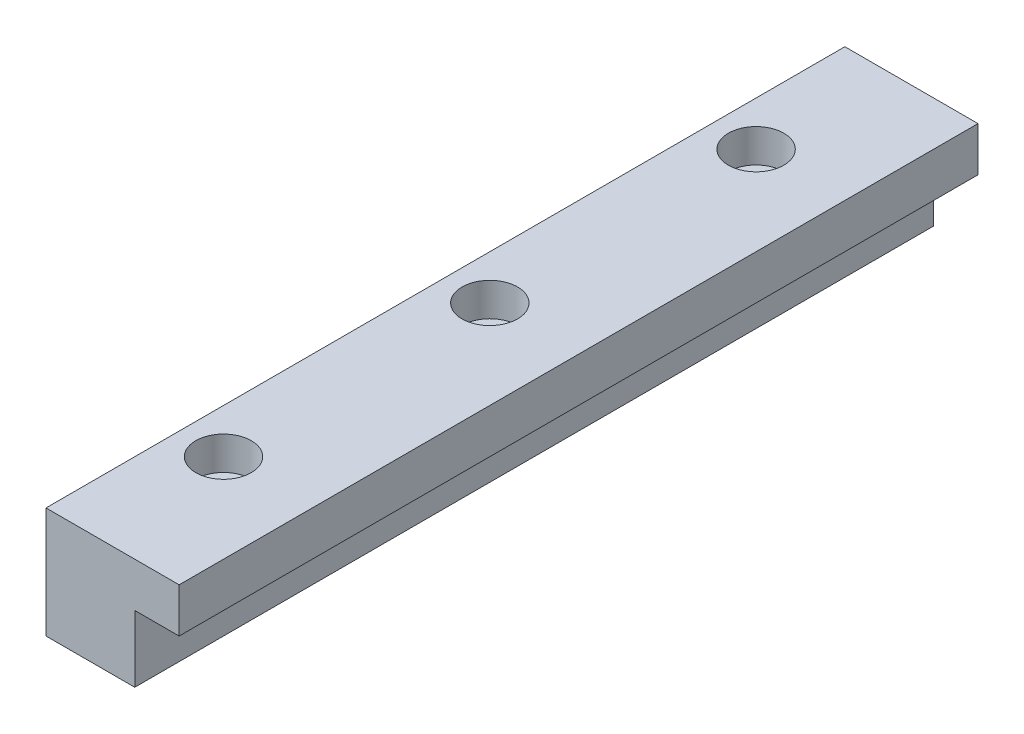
ISO-10303-21;
HEADER;
FILE_DESCRIPTION(('STEP AP214'),'2;1');
FILE_NAME('part.step','',(''),(''),'','','');
FILE_SCHEMA(('AUTOMOTIVE_DESIGN { 1 0 10303 214 1 1 1 1 }'));
ENDSEC;
DATA;
#1=APPLICATION_CONTEXT('core data for automotive mechanical design processes');
#2=APPLICATION_PROTOCOL_DEFINITION('international standard','automotive_design',2000,#1);
#3=PRODUCT_CONTEXT('',#1,'mechanical');
#4=PRODUCT('Part','Part','',(#3));
#5=PRODUCT_RELATED_PRODUCT_CATEGORY('part','',(#4));
#6=PRODUCT_DEFINITION_FORMATION('','',#4);
#7=PRODUCT_DEFINITION_CONTEXT('part definition',#1,'design');
#8=PRODUCT_DEFINITION('design','',#6,#7);
#9=PRODUCT_DEFINITION_SHAPE('','',#8);
#10=(LENGTH_UNIT() NAMED_UNIT(*) SI_UNIT(.MILLI.,.METRE.));
#11=(NAMED_UNIT(*) PLANE_ANGLE_UNIT() SI_UNIT($,.RADIAN.));
#12=(NAMED_UNIT(*) SI_UNIT($,.STERADIAN.) SOLID_ANGLE_UNIT());
#13=UNCERTAINTY_MEASURE_WITH_UNIT(LENGTH_MEASURE(1.E-05),#10,'distance_accuracy_value','');
#14=(GEOMETRIC_REPRESENTATION_CONTEXT(3) GLOBAL_UNCERTAINTY_ASSIGNED_CONTEXT((#13)) GLOBAL_UNIT_ASSIGNED_CONTEXT((#10,
#11,#12)) REPRESENTATION_CONTEXT('',''));
#15=CARTESIAN_POINT('',(0.,0.,0.));
#16=DIRECTION('',(0.,0.,1.));
#17=DIRECTION('',(1.,0.,0.));
#18=AXIS2_PLACEMENT_3D('',#15,#16,#17);
#19=CARTESIAN_POINT('',(6.35,-15.875,114.3));
#20=DIRECTION('',(0.,1.,0.));
#21=DIRECTION('',(-1.,0.,0.));
#22=AXIS2_PLACEMENT_3D('',#19,#20,#21);
#23=PLANE('',#22);
#24=CARTESIAN_POINT('',(-6.35,-15.875,-76.2));
#25=DIRECTION('',(0.,1.,0.));
#26=DIRECTION('',(0.,0.,1.));
#27=AXIS2_PLACEMENT_3D('',#24,#25,#26);
#28=CIRCLE('',#27,5.04189999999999);
#29=CARTESIAN_POINT('',(-6.35,-15.875,-71.1581));
#30=VERTEX_POINT('',#29);
#31=EDGE_CURVE('E158',#30,#30,#28,.T.);
#32=ORIENTED_EDGE('',*,*,#31,.T.);
#33=EDGE_LOOP('',(#32));
#34=FACE_BOUND('',#33,.T.);
#35=CARTESIAN_POINT('',(-6.35,-15.875,0.));
#36=DIRECTION('',(0.,1.,0.));
#37=DIRECTION('',(0.,0.,1.));
#38=AXIS2_PLACEMENT_3D('',#35,#36,#37);
#39=CIRCLE('',#38,5.04189999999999);
#40=CARTESIAN_POINT('',(-6.35,-15.875,5.04189999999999));
#41=VERTEX_POINT('',#40);
#42=EDGE_CURVE('E162',#41,#41,#39,.T.);
#43=ORIENTED_EDGE('',*,*,#42,.T.);
#44=EDGE_LOOP('',(#43));
#45=FACE_BOUND('',#44,.T.);
#46=CARTESIAN_POINT('',(-6.35,-15.875,76.2));
#47=DIRECTION('',(0.,1.,0.));
#48=DIRECTION('',(0.,0.,1.));
#49=AXIS2_PLACEMENT_3D('',#46,#47,#48);
#50=CIRCLE('',#49,5.04189999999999);
#51=CARTESIAN_POINT('',(-6.35,-15.875,81.2419));
#52=VERTEX_POINT('',#51);
#53=EDGE_CURVE('E118',#52,#52,#50,.T.);
#54=ORIENTED_EDGE('',*,*,#53,.T.);
#55=EDGE_LOOP('',(#54));
#56=FACE_BOUND('',#55,.T.);
#57=DIRECTION('',(1.,0.,0.));
#58=VECTOR('',#57,1.);
#59=CARTESIAN_POINT('',(6.35,-15.875,-114.3));
#60=LINE('',#59,#58);
#61=CARTESIAN_POINT('',(-19.05,-15.875,-114.3));
#62=VERTEX_POINT('',#61);
#63=CARTESIAN_POINT('',(6.35,-15.875,-114.3));
#64=VERTEX_POINT('',#63);
#65=EDGE_CURVE('E114',#62,#64,#60,.T.);
#66=ORIENTED_EDGE('',*,*,#65,.T.);
#67=DIRECTION('',(0.,0.,-1.));
#68=VECTOR('',#67,1.);
#69=CARTESIAN_POINT('',(6.35,-15.875,114.3));
#70=LINE('',#69,#68);
#71=CARTESIAN_POINT('',(6.35,-15.875,114.3));
#72=VERTEX_POINT('',#71);
#73=EDGE_CURVE('E11',#72,#64,#70,.T.);
#74=ORIENTED_EDGE('',*,*,#73,.F.);
#75=DIRECTION('',(1.,0.,0.));
#76=VECTOR('',#75,1.);
#77=CARTESIAN_POINT('',(6.35,-15.875,114.3));
#78=LINE('',#77,#76);
#79=CARTESIAN_POINT('',(-19.05,-15.875,114.3));
#80=VERTEX_POINT('',#79);
#81=EDGE_CURVE('E125',#80,#72,#78,.T.);
#82=ORIENTED_EDGE('',*,*,#81,.F.);
#83=DIRECTION('',(0.,0.,-1.));
#84=VECTOR('',#83,1.);
#85=CARTESIAN_POINT('',(-19.05,-15.875,114.3));
#86=LINE('',#85,#84);
#87=EDGE_CURVE('E110',#80,#62,#86,.T.);
#88=ORIENTED_EDGE('',*,*,#87,.T.);
#89=EDGE_LOOP('',(#66,#74,#82,#88));
#90=FACE_BOUND('',#89,.T.);
#91=ADVANCED_FACE('F30',(#34,#45,#56,#90),#23,.F.);
#92=CARTESIAN_POINT('',(6.35,-15.875,114.3));
#93=DIRECTION('',(-1.,0.,0.));
#94=DIRECTION('',(0.,-1.,0.));
#95=AXIS2_PLACEMENT_3D('',#92,#93,#94);
#96=PLANE('',#95);
#97=DIRECTION('',(0.,1.,0.));
#98=VECTOR('',#97,1.);
#99=CARTESIAN_POINT('',(6.35,-15.875,-114.3));
#100=LINE('',#99,#98);
#101=CARTESIAN_POINT('',(6.35,3.17499999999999,-114.3));
#102=VERTEX_POINT('',#101);
#103=EDGE_CURVE('E117',#64,#102,#100,.T.);
#104=ORIENTED_EDGE('',*,*,#103,.T.);
#105=DIRECTION('',(0.,0.,-1.));
#106=VECTOR('',#105,1.);
#107=CARTESIAN_POINT('',(6.35,3.17499999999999,114.3));
#108=LINE('',#107,#106);
#109=CARTESIAN_POINT('',(6.35,3.17499999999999,114.3));
#110=VERTEX_POINT('',#109);
#111=EDGE_CURVE('E38',#110,#102,#108,.T.);
#112=ORIENTED_EDGE('',*,*,#111,.F.);
#113=DIRECTION('',(0.,1.,0.));
#114=VECTOR('',#113,1.);
#115=CARTESIAN_POINT('',(6.35,-15.875,114.3));
#116=LINE('',#115,#114);
#117=EDGE_CURVE('E83',#72,#110,#116,.T.);
#118=ORIENTED_EDGE('',*,*,#117,.F.);
#119=ORIENTED_EDGE('',*,*,#73,.T.);
#120=EDGE_LOOP('',(#104,#112,#118,#119));
#121=FACE_BOUND('',#120,.T.);
#122=ADVANCED_FACE('F150',(#121),#96,.F.);
#123=CARTESIAN_POINT('',(19.05,3.175,114.3));
#124=DIRECTION('',(0.,1.,0.));
#125=DIRECTION('',(-1.,0.,0.));
#126=AXIS2_PLACEMENT_3D('',#123,#124,#125);
#127=PLANE('',#126);
#128=DIRECTION('',(1.,0.,0.));
#129=VECTOR('',#128,1.);
#130=CARTESIAN_POINT('',(19.05,3.175,-114.3));
#131=LINE('',#130,#129);
#132=CARTESIAN_POINT('',(19.05,3.175,-114.3));
#133=VERTEX_POINT('',#132);
#134=EDGE_CURVE('E120',#102,#133,#131,.T.);
#135=ORIENTED_EDGE('',*,*,#134,.T.);
#136=DIRECTION('',(0.,0.,-1.));
#137=VECTOR('',#136,1.);
#138=CARTESIAN_POINT('',(19.05,3.175,114.3));
#139=LINE('',#138,#137);
#140=CARTESIAN_POINT('',(19.05,3.175,114.3));
#141=VERTEX_POINT('',#140);
#142=EDGE_CURVE('E105',#141,#133,#139,.T.);
#143=ORIENTED_EDGE('',*,*,#142,.F.);
#144=DIRECTION('',(1.,0.,0.));
#145=VECTOR('',#144,1.);
#146=CARTESIAN_POINT('',(19.05,3.175,114.3));
#147=LINE('',#146,#145);
#148=EDGE_CURVE('E96',#110,#141,#147,.T.);
#149=ORIENTED_EDGE('',*,*,#148,.F.);
#150=ORIENTED_EDGE('',*,*,#111,.T.);
#151=EDGE_LOOP('',(#135,#143,#149,#150));
#152=FACE_BOUND('',#151,.T.);
#153=ADVANCED_FACE('F131',(#152),#127,.F.);
#154=CARTESIAN_POINT('',(19.05,15.875,114.3));
#155=DIRECTION('',(-1.,0.,0.));
#156=DIRECTION('',(0.,0.,1.));
#157=AXIS2_PLACEMENT_3D('',#154,#155,#156);
#158=PLANE('',#157);
#159=DIRECTION('',(0.,1.,0.));
#160=VECTOR('',#159,1.);
#161=CARTESIAN_POINT('',(19.05,15.875,-114.3));
#162=LINE('',#161,#160);
#163=CARTESIAN_POINT('',(19.05,15.875,-114.3));
#164=VERTEX_POINT('',#163);
#165=EDGE_CURVE('E104',#133,#164,#162,.T.);
#166=ORIENTED_EDGE('',*,*,#165,.T.);
#167=DIRECTION('',(0.,0.,-1.));
#168=VECTOR('',#167,1.);
#169=CARTESIAN_POINT('',(19.05,15.875,114.3));
#170=LINE('',#169,#168);
#171=CARTESIAN_POINT('',(19.05,15.875,114.3));
#172=VERTEX_POINT('',#171);
#173=EDGE_CURVE('E101',#172,#164,#170,.T.);
#174=ORIENTED_EDGE('',*,*,#173,.F.);
#175=DIRECTION('',(0.,1.,0.));
#176=VECTOR('',#175,1.);
#177=CARTESIAN_POINT('',(19.05,15.875,114.3));
#178=LINE('',#177,#176);
#179=EDGE_CURVE('E90',#141,#172,#178,.T.);
#180=ORIENTED_EDGE('',*,*,#179,.F.);
#181=ORIENTED_EDGE('',*,*,#142,.T.);
#182=EDGE_LOOP('',(#166,#174,#180,#181));
#183=FACE_BOUND('',#182,.T.);
#184=ADVANCED_FACE('F102',(#183),#158,.F.);
#185=CARTESIAN_POINT('',(-19.05,15.875,114.3));
#186=DIRECTION('',(0.,-1.,0.));
#187=DIRECTION('',(0.,0.,-1.));
#188=AXIS2_PLACEMENT_3D('',#185,#186,#187);
#189=PLANE('',#188);
#190=CARTESIAN_POINT('',(-6.35,15.875,-76.2));
#191=DIRECTION('',(0.,1.,0.));
#192=DIRECTION('',(0.,0.,1.));
#193=AXIS2_PLACEMENT_3D('',#190,#191,#192);
#194=CIRCLE('',#193,7.9375);
#195=CARTESIAN_POINT('',(-6.35,15.875,-68.2625));
#196=VERTEX_POINT('',#195);
#197=EDGE_CURVE('E196',#196,#196,#194,.T.);
#198=ORIENTED_EDGE('',*,*,#197,.F.);
#199=EDGE_LOOP('',(#198));
#200=FACE_BOUND('',#199,.T.);
#201=CARTESIAN_POINT('',(-6.35,15.875,0.));
#202=DIRECTION('',(0.,1.,0.));
#203=DIRECTION('',(0.,0.,1.));
#204=AXIS2_PLACEMENT_3D('',#201,#202,#203);
#205=CIRCLE('',#204,7.9375);
#206=CARTESIAN_POINT('',(-6.35,15.875,7.9375));
#207=VERTEX_POINT('',#206);
#208=EDGE_CURVE('E186',#207,#207,#205,.T.);
#209=ORIENTED_EDGE('',*,*,#208,.F.);
#210=EDGE_LOOP('',(#209));
#211=FACE_BOUND('',#210,.T.);
#212=CARTESIAN_POINT('',(-6.35,15.875,76.2));
#213=DIRECTION('',(0.,1.,0.));
#214=DIRECTION('',(0.,0.,1.));
#215=AXIS2_PLACEMENT_3D('',#212,#213,#214);
#216=CIRCLE('',#215,7.9375);
#217=CARTESIAN_POINT('',(-6.35,15.875,84.1375));
#218=VERTEX_POINT('',#217);
#219=EDGE_CURVE('E176',#218,#218,#216,.T.);
#220=ORIENTED_EDGE('',*,*,#219,.F.);
#221=EDGE_LOOP('',(#220));
#222=FACE_BOUND('',#221,.T.);
#223=DIRECTION('',(-1.,0.,0.));
#224=VECTOR('',#223,1.);
#225=CARTESIAN_POINT('',(-19.05,15.875,-114.3));
#226=LINE('',#225,#224);
#227=CARTESIAN_POINT('',(-19.05,15.875,-114.3));
#228=VERTEX_POINT('',#227);
#229=EDGE_CURVE('E69',#164,#228,#226,.T.);
#230=ORIENTED_EDGE('',*,*,#229,.T.);
#231=DIRECTION('',(0.,0.,-1.));
#232=VECTOR('',#231,1.);
#233=CARTESIAN_POINT('',(-19.05,15.875,114.3));
#234=LINE('',#233,#232);
#235=CARTESIAN_POINT('',(-19.05,15.875,114.3));
#236=VERTEX_POINT('',#235);
#237=EDGE_CURVE('E106',#236,#228,#234,.T.);
#238=ORIENTED_EDGE('',*,*,#237,.F.);
#239=DIRECTION('',(-1.,0.,0.));
#240=VECTOR('',#239,1.);
#241=CARTESIAN_POINT('',(-19.05,15.875,114.3));
#242=LINE('',#241,#240);
#243=EDGE_CURVE('E94',#172,#236,#242,.T.);
#244=ORIENTED_EDGE('',*,*,#243,.F.);
#245=ORIENTED_EDGE('',*,*,#173,.T.);
#246=EDGE_LOOP('',(#230,#238,#244,#245));
#247=FACE_BOUND('',#246,.T.);
#248=ADVANCED_FACE('F108',(#200,#211,#222,#247),#189,.F.);
#249=CARTESIAN_POINT('',(-19.05,-15.875,114.3));
#250=DIRECTION('',(1.,0.,0.));
#251=DIRECTION('',(0.,1.,0.));
#252=AXIS2_PLACEMENT_3D('',#249,#250,#251);
#253=PLANE('',#252);
#254=DIRECTION('',(0.,-1.,0.));
#255=VECTOR('',#254,1.);
#256=CARTESIAN_POINT('',(-19.05,-15.875,-114.3));
#257=LINE('',#256,#255);
#258=EDGE_CURVE('E75',#228,#62,#257,.T.);
#259=ORIENTED_EDGE('',*,*,#258,.T.);
#260=ORIENTED_EDGE('',*,*,#87,.F.);
#261=DIRECTION('',(0.,-1.,0.));
#262=VECTOR('',#261,1.);
#263=CARTESIAN_POINT('',(-19.05,-15.875,114.3));
#264=LINE('',#263,#262);
#265=EDGE_CURVE('E46',#236,#80,#264,.T.);
#266=ORIENTED_EDGE('',*,*,#265,.F.);
#267=ORIENTED_EDGE('',*,*,#237,.T.);
#268=EDGE_LOOP('',(#259,#260,#266,#267));
#269=FACE_BOUND('',#268,.T.);
#270=ADVANCED_FACE('F138',(#269),#253,.F.);
#271=CARTESIAN_POINT('',(-19.05,-15.875,114.3));
#272=DIRECTION('',(0.,0.,-1.));
#273=DIRECTION('',(-1.,0.,0.));
#274=AXIS2_PLACEMENT_3D('',#271,#272,#273);
#275=PLANE('',#274);
#276=ORIENTED_EDGE('',*,*,#81,.T.);
#277=ORIENTED_EDGE('',*,*,#117,.T.);
#278=ORIENTED_EDGE('',*,*,#148,.T.);
#279=ORIENTED_EDGE('',*,*,#179,.T.);
#280=ORIENTED_EDGE('',*,*,#243,.T.);
#281=ORIENTED_EDGE('',*,*,#265,.T.);
#282=EDGE_LOOP('',(#276,#277,#278,#279,#280,#281));
#283=FACE_BOUND('',#282,.T.);
#284=ADVANCED_FACE('F92',(#283),#275,.F.);
#285=CARTESIAN_POINT('',(-19.05,-15.875,-114.3));
#286=DIRECTION('',(0.,0.,-1.));
#287=DIRECTION('',(-1.,0.,0.));
#288=AXIS2_PLACEMENT_3D('',#285,#286,#287);
#289=PLANE('',#288);
#290=ORIENTED_EDGE('',*,*,#65,.F.);
#291=ORIENTED_EDGE('',*,*,#258,.F.);
#292=ORIENTED_EDGE('',*,*,#229,.F.);
#293=ORIENTED_EDGE('',*,*,#165,.F.);
#294=ORIENTED_EDGE('',*,*,#134,.F.);
#295=ORIENTED_EDGE('',*,*,#103,.F.);
#296=EDGE_LOOP('',(#290,#291,#292,#293,#294,#295));
#297=FACE_BOUND('',#296,.T.);
#298=ADVANCED_FACE('F134',(#297),#289,.T.);
#299=CARTESIAN_POINT('',(-6.35,15.875,76.2));
#300=DIRECTION('',(0.,1.,0.));
#301=DIRECTION('',(0.,0.,1.));
#302=AXIS2_PLACEMENT_3D('',#299,#300,#301);
#303=CYLINDRICAL_SURFACE('',#302,5.0419);
#304=ORIENTED_EDGE('',*,*,#53,.F.);
#305=EDGE_LOOP('',(#304));
#306=FACE_BOUND('',#305,.T.);
#307=CARTESIAN_POINT('',(-6.35,6.35,76.2));
#308=DIRECTION('',(0.,1.,0.));
#309=DIRECTION('',(0.,0.,1.));
#310=AXIS2_PLACEMENT_3D('',#307,#308,#309);
#311=CIRCLE('',#310,5.0419);
#312=CARTESIAN_POINT('',(-6.35,6.35,81.2419));
#313=VERTEX_POINT('',#312);
#314=EDGE_CURVE('E166',#313,#313,#311,.T.);
#315=ORIENTED_EDGE('',*,*,#314,.T.);
#316=EDGE_LOOP('',(#315));
#317=FACE_BOUND('',#316,.T.);
#318=ADVANCED_FACE('F219',(#306,#317),#303,.F.);
#319=CARTESIAN_POINT('',(-1.3081,6.35,76.2));
#320=DIRECTION('',(0.,-1.,0.));
#321=DIRECTION('',(0.,0.,-1.));
#322=AXIS2_PLACEMENT_3D('',#319,#320,#321);
#323=PLANE('',#322);
#324=ORIENTED_EDGE('',*,*,#314,.F.);
#325=EDGE_LOOP('',(#324));
#326=FACE_BOUND('',#325,.T.);
#327=CARTESIAN_POINT('',(-6.35,6.35,76.2));
#328=DIRECTION('',(0.,1.,0.));
#329=DIRECTION('',(0.,0.,1.));
#330=AXIS2_PLACEMENT_3D('',#327,#328,#329);
#331=CIRCLE('',#330,7.9375);
#332=CARTESIAN_POINT('',(-6.35,6.35,84.1375));
#333=VERTEX_POINT('',#332);
#334=EDGE_CURVE('E169',#333,#333,#331,.T.);
#335=ORIENTED_EDGE('',*,*,#334,.T.);
#336=EDGE_LOOP('',(#335));
#337=FACE_BOUND('',#336,.T.);
#338=ADVANCED_FACE('F209',(#326,#337),#323,.F.);
#339=CARTESIAN_POINT('',(-6.35,15.875,76.2));
#340=DIRECTION('',(0.,1.,0.));
#341=DIRECTION('',(0.,0.,1.));
#342=AXIS2_PLACEMENT_3D('',#339,#340,#341);
#343=CYLINDRICAL_SURFACE('',#342,7.9375);
#344=ORIENTED_EDGE('',*,*,#334,.F.);
#345=EDGE_LOOP('',(#344));
#346=FACE_BOUND('',#345,.T.);
#347=ORIENTED_EDGE('',*,*,#219,.T.);
#348=EDGE_LOOP('',(#347));
#349=FACE_BOUND('',#348,.T.);
#350=ADVANCED_FACE('F206',(#346,#349),#343,.F.);
#351=CARTESIAN_POINT('',(-6.35,15.875,0.));
#352=DIRECTION('',(0.,1.,0.));
#353=DIRECTION('',(0.,0.,1.));
#354=AXIS2_PLACEMENT_3D('',#351,#352,#353);
#355=CYLINDRICAL_SURFACE('',#354,5.0419);
#356=ORIENTED_EDGE('',*,*,#42,.F.);
#357=EDGE_LOOP('',(#356));
#358=FACE_BOUND('',#357,.T.);
#359=CARTESIAN_POINT('',(-6.35,6.35,0.));
#360=DIRECTION('',(0.,1.,0.));
#361=DIRECTION('',(0.,0.,1.));
#362=AXIS2_PLACEMENT_3D('',#359,#360,#361);
#363=CIRCLE('',#362,5.0419);
#364=CARTESIAN_POINT('',(-6.35,6.35,5.0419));
#365=VERTEX_POINT('',#364);
#366=EDGE_CURVE('E180',#365,#365,#363,.T.);
#367=ORIENTED_EDGE('',*,*,#366,.T.);
#368=EDGE_LOOP('',(#367));
#369=FACE_BOUND('',#368,.T.);
#370=ADVANCED_FACE('F208',(#358,#369),#355,.F.);
#371=CARTESIAN_POINT('',(-1.3081,6.35,0.));
#372=DIRECTION('',(0.,-1.,0.));
#373=DIRECTION('',(0.,0.,-1.));
#374=AXIS2_PLACEMENT_3D('',#371,#372,#373);
#375=PLANE('',#374);
#376=ORIENTED_EDGE('',*,*,#366,.F.);
#377=EDGE_LOOP('',(#376));
#378=FACE_BOUND('',#377,.T.);
#379=CARTESIAN_POINT('',(-6.35,6.35,0.));
#380=DIRECTION('',(0.,1.,0.));
#381=DIRECTION('',(0.,0.,1.));
#382=AXIS2_PLACEMENT_3D('',#379,#380,#381);
#383=CIRCLE('',#382,7.9375);
#384=CARTESIAN_POINT('',(-6.35,6.35,7.9375));
#385=VERTEX_POINT('',#384);
#386=EDGE_CURVE('E183',#385,#385,#383,.T.);
#387=ORIENTED_EDGE('',*,*,#386,.T.);
#388=EDGE_LOOP('',(#387));
#389=FACE_BOUND('',#388,.T.);
#390=ADVANCED_FACE('F216',(#378,#389),#375,.F.);
#391=CARTESIAN_POINT('',(-6.35,15.875,0.));
#392=DIRECTION('',(0.,1.,0.));
#393=DIRECTION('',(0.,0.,1.));
#394=AXIS2_PLACEMENT_3D('',#391,#392,#393);
#395=CYLINDRICAL_SURFACE('',#394,7.9375);
#396=ORIENTED_EDGE('',*,*,#386,.F.);
#397=EDGE_LOOP('',(#396));
#398=FACE_BOUND('',#397,.T.);
#399=ORIENTED_EDGE('',*,*,#208,.T.);
#400=EDGE_LOOP('',(#399));
#401=FACE_BOUND('',#400,.T.);
#402=ADVANCED_FACE('F258',(#398,#401),#395,.F.);
#403=CARTESIAN_POINT('',(-6.35,15.875,-76.2));
#404=DIRECTION('',(0.,1.,0.));
#405=DIRECTION('',(0.,0.,1.));
#406=AXIS2_PLACEMENT_3D('',#403,#404,#405);
#407=CYLINDRICAL_SURFACE('',#406,5.0419);
#408=ORIENTED_EDGE('',*,*,#31,.F.);
#409=EDGE_LOOP('',(#408));
#410=FACE_BOUND('',#409,.T.);
#411=CARTESIAN_POINT('',(-6.35,6.35,-76.2));
#412=DIRECTION('',(0.,1.,0.));
#413=DIRECTION('',(0.,0.,1.));
#414=AXIS2_PLACEMENT_3D('',#411,#412,#413);
#415=CIRCLE('',#414,5.0419);
#416=CARTESIAN_POINT('',(-6.35,6.35,-71.1581));
#417=VERTEX_POINT('',#416);
#418=EDGE_CURVE('E190',#417,#417,#415,.T.);
#419=ORIENTED_EDGE('',*,*,#418,.T.);
#420=EDGE_LOOP('',(#419));
#421=FACE_BOUND('',#420,.T.);
#422=ADVANCED_FACE('F266',(#410,#421),#407,.F.);
#423=CARTESIAN_POINT('',(-1.3081,6.35,-76.2));
#424=DIRECTION('',(0.,-1.,0.));
#425=DIRECTION('',(0.,0.,-1.));
#426=AXIS2_PLACEMENT_3D('',#423,#424,#425);
#427=PLANE('',#426);
#428=ORIENTED_EDGE('',*,*,#418,.F.);
#429=EDGE_LOOP('',(#428));
#430=FACE_BOUND('',#429,.T.);
#431=CARTESIAN_POINT('',(-6.35,6.35,-76.2));
#432=DIRECTION('',(0.,1.,0.));
#433=DIRECTION('',(0.,0.,1.));
#434=AXIS2_PLACEMENT_3D('',#431,#432,#433);
#435=CIRCLE('',#434,7.9375);
#436=CARTESIAN_POINT('',(-6.35,6.35,-68.2625));
#437=VERTEX_POINT('',#436);
#438=EDGE_CURVE('E193',#437,#437,#435,.T.);
#439=ORIENTED_EDGE('',*,*,#438,.T.);
#440=EDGE_LOOP('',(#439));
#441=FACE_BOUND('',#440,.T.);
#442=ADVANCED_FACE('F291',(#430,#441),#427,.F.);
#443=CARTESIAN_POINT('',(-6.35,15.875,-76.2));
#444=DIRECTION('',(0.,1.,0.));
#445=DIRECTION('',(0.,0.,1.));
#446=AXIS2_PLACEMENT_3D('',#443,#444,#445);
#447=CYLINDRICAL_SURFACE('',#446,7.9375);
#448=ORIENTED_EDGE('',*,*,#438,.F.);
#449=EDGE_LOOP('',(#448));
#450=FACE_BOUND('',#449,.T.);
#451=ORIENTED_EDGE('',*,*,#197,.T.);
#452=EDGE_LOOP('',(#451));
#453=FACE_BOUND('',#452,.T.);
#454=ADVANCED_FACE('F200',(#450,#453),#447,.F.);
#455=CLOSED_SHELL('',(#91,#122,#153,#184,#248,#270,#284,#298,#318,#338,#350,#370,#390,#402,#422,
#442,#454));
#456=MANIFOLD_SOLID_BREP('B2',#455);
#457=ADVANCED_BREP_SHAPE_REPRESENTATION('',(#18,#456),#14);
#458=SHAPE_DEFINITION_REPRESENTATION(#9,#457);
ENDSEC;
END-ISO-10303-21;
